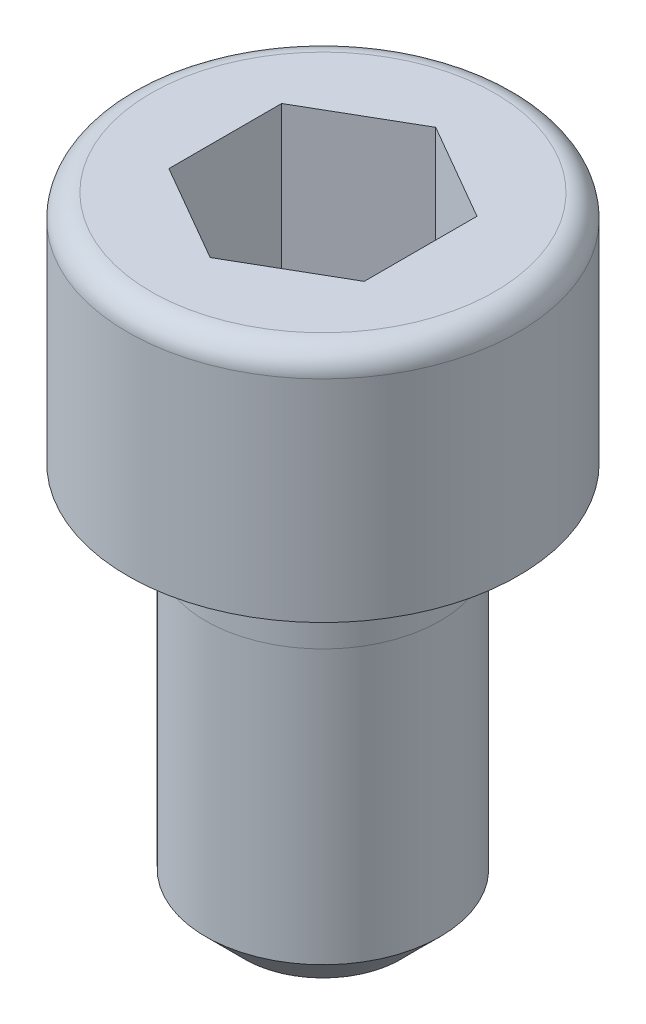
ISO-10303-21;
HEADER;
FILE_DESCRIPTION(('STEP AP214'),'2;1');
FILE_NAME('part.step','',(''),(''),'','','');
FILE_SCHEMA(('AUTOMOTIVE_DESIGN { 1 0 10303 214 1 1 1 1 }'));
ENDSEC;
DATA;
#1=APPLICATION_CONTEXT('core data for automotive mechanical design processes');
#2=APPLICATION_PROTOCOL_DEFINITION('international standard','automotive_design',2000,#1);
#3=PRODUCT_CONTEXT('',#1,'mechanical');
#4=PRODUCT('Part','Part','',(#3));
#5=PRODUCT_RELATED_PRODUCT_CATEGORY('part','',(#4));
#6=PRODUCT_DEFINITION_FORMATION('','',#4);
#7=PRODUCT_DEFINITION_CONTEXT('part definition',#1,'design');
#8=PRODUCT_DEFINITION('design','',#6,#7);
#9=PRODUCT_DEFINITION_SHAPE('','',#8);
#10=(LENGTH_UNIT() NAMED_UNIT(*) SI_UNIT(.MILLI.,.METRE.));
#11=(NAMED_UNIT(*) PLANE_ANGLE_UNIT() SI_UNIT($,.RADIAN.));
#12=(NAMED_UNIT(*) SI_UNIT($,.STERADIAN.) SOLID_ANGLE_UNIT());
#13=UNCERTAINTY_MEASURE_WITH_UNIT(LENGTH_MEASURE(1.E-05),#10,'distance_accuracy_value','');
#14=(GEOMETRIC_REPRESENTATION_CONTEXT(3) GLOBAL_UNCERTAINTY_ASSIGNED_CONTEXT((#13)) GLOBAL_UNIT_ASSIGNED_CONTEXT((#10,
#11,#12)) REPRESENTATION_CONTEXT('',''));
#15=CARTESIAN_POINT('',(0.,0.,0.));
#16=DIRECTION('',(0.,0.,1.));
#17=DIRECTION('',(1.,0.,0.));
#18=AXIS2_PLACEMENT_3D('',#15,#16,#17);
#19=CARTESIAN_POINT('',(0.,65.1172922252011,0.));
#20=DIRECTION('',(0.,1.,0.));
#21=DIRECTION('',(-1.,0.,0.));
#22=AXIS2_PLACEMENT_3D('',#19,#20,#21);
#23=CYLINDRICAL_SURFACE('',#22,2.99999999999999);
#24=CARTESIAN_POINT('',(0.,-15.,0.));
#25=DIRECTION('',(0.,1.,0.));
#26=DIRECTION('',(-1.,0.,0.));
#27=AXIS2_PLACEMENT_3D('',#24,#25,#26);
#28=CIRCLE('',#27,3.);
#29=CARTESIAN_POINT('',(-3.00000000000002,-15.,0.));
#30=VERTEX_POINT('',#29);
#31=EDGE_CURVE('E468',#30,#30,#28,.T.);
#32=ORIENTED_EDGE('',*,*,#31,.T.);
#33=EDGE_LOOP('',(#32));
#34=FACE_BOUND('',#33,.T.);
#35=CARTESIAN_POINT('',(0.,-7.99999999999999,0.));
#36=DIRECTION('',(0.,1.,0.));
#37=DIRECTION('',(-1.,0.,0.));
#38=AXIS2_PLACEMENT_3D('',#35,#36,#37);
#39=CIRCLE('',#38,2.99999999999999);
#40=CARTESIAN_POINT('',(-3.,-7.99999999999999,0.));
#41=VERTEX_POINT('',#40);
#42=EDGE_CURVE('E11',#41,#41,#39,.T.);
#43=ORIENTED_EDGE('',*,*,#42,.F.);
#44=EDGE_LOOP('',(#43));
#45=FACE_BOUND('',#44,.T.);
#46=ADVANCED_FACE('F348',(#34,#45),#23,.T.);
#47=CARTESIAN_POINT('',(2.,-16.,4.9960036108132E-13));
#48=DIRECTION('',(0.,-1.,0.));
#49=DIRECTION('',(1.,0.,0.));
#50=AXIS2_PLACEMENT_3D('',#47,#48,#49);
#51=PLANE('',#50);
#52=CARTESIAN_POINT('',(0.,-16.,0.));
#53=DIRECTION('',(0.,1.,0.));
#54=DIRECTION('',(-1.,0.,0.));
#55=AXIS2_PLACEMENT_3D('',#52,#53,#54);
#56=CIRCLE('',#55,2.);
#57=CARTESIAN_POINT('',(-1.99999999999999,-16.,0.));
#58=VERTEX_POINT('',#57);
#59=EDGE_CURVE('E357',#58,#58,#56,.T.);
#60=ORIENTED_EDGE('',*,*,#59,.F.);
#61=EDGE_LOOP('',(#60));
#62=FACE_BOUND('',#61,.T.);
#63=ADVANCED_FACE('F350',(#62),#51,.T.);
#64=CARTESIAN_POINT('',(0.,-16.,0.));
#65=DIRECTION('',(0.,1.,0.));
#66=DIRECTION('',(-1.,0.,0.));
#67=AXIS2_PLACEMENT_3D('',#64,#65,#66);
#68=CONICAL_SURFACE('',#67,2.,0.785398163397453);
#69=ORIENTED_EDGE('',*,*,#31,.F.);
#70=EDGE_LOOP('',(#69));
#71=FACE_BOUND('',#70,.T.);
#72=ORIENTED_EDGE('',*,*,#59,.T.);
#73=EDGE_LOOP('',(#72));
#74=FACE_BOUND('',#73,.T.);
#75=ADVANCED_FACE('F473',(#71,#74),#68,.T.);
#76=ORIENTED_EDGE('',*,*,#42,.T.);
#77=EDGE_LOOP('',(#76));
#78=FACE_BOUND('',#77,.T.);
#79=CARTESIAN_POINT('',(0.,-6.,0.));
#80=DIRECTION('',(0.,1.,0.));
#81=DIRECTION('',(-1.,0.,0.));
#82=AXIS2_PLACEMENT_3D('',#79,#80,#81);
#83=CIRCLE('',#82,2.99999999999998);
#84=CARTESIAN_POINT('',(-2.99999999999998,-6.,0.));
#85=VERTEX_POINT('',#84);
#86=EDGE_CURVE('E465',#85,#85,#83,.T.);
#87=ORIENTED_EDGE('',*,*,#86,.F.);
#88=EDGE_LOOP('',(#87));
#89=FACE_BOUND('',#88,.T.);
#90=ADVANCED_FACE('F479',(#78,#89),#23,.T.);
#91=CARTESIAN_POINT('',(3.00000000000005,-6.,4.9960036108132E-13));
#92=DIRECTION('',(0.,1.,0.));
#93=DIRECTION('',(-1.,0.,0.));
#94=AXIS2_PLACEMENT_3D('',#91,#92,#93);
#95=PLANE('',#94);
#96=CARTESIAN_POINT('',(0.,-6.,0.));
#97=DIRECTION('',(0.,1.,0.));
#98=DIRECTION('',(-1.,0.,0.));
#99=AXIS2_PLACEMENT_3D('',#96,#97,#98);
#100=CIRCLE('',#99,4.99999999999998);
#101=CARTESIAN_POINT('',(-4.99999999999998,-6.,0.));
#102=VERTEX_POINT('',#101);
#103=EDGE_CURVE('E462',#102,#102,#100,.T.);
#104=ORIENTED_EDGE('',*,*,#103,.F.);
#105=EDGE_LOOP('',(#104));
#106=FACE_BOUND('',#105,.T.);
#107=ORIENTED_EDGE('',*,*,#86,.T.);
#108=EDGE_LOOP('',(#107));
#109=FACE_BOUND('',#108,.T.);
#110=ADVANCED_FACE('F490',(#106,#109),#95,.F.);
#111=CARTESIAN_POINT('',(0.,65.1172922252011,0.));
#112=DIRECTION('',(0.,1.,0.));
#113=DIRECTION('',(-1.,0.,0.));
#114=AXIS2_PLACEMENT_3D('',#111,#112,#113);
#115=CYLINDRICAL_SURFACE('',#114,4.99999999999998);
#116=CARTESIAN_POINT('',(0.,-0.600000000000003,0.));
#117=DIRECTION('',(0.,1.,0.));
#118=DIRECTION('',(-1.,0.,0.));
#119=AXIS2_PLACEMENT_3D('',#116,#117,#118);
#120=CIRCLE('',#119,4.99999999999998);
#121=CARTESIAN_POINT('',(-4.99999999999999,-0.600000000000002,0.));
#122=VERTEX_POINT('',#121);
#123=EDGE_CURVE('E459',#122,#122,#120,.T.);
#124=ORIENTED_EDGE('',*,*,#123,.F.);
#125=EDGE_LOOP('',(#124));
#126=FACE_BOUND('',#125,.T.);
#127=ORIENTED_EDGE('',*,*,#103,.T.);
#128=EDGE_LOOP('',(#127));
#129=FACE_BOUND('',#128,.T.);
#130=ADVANCED_FACE('F495',(#126,#129),#115,.T.);
#131=CARTESIAN_POINT('',(0.,-0.600000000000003,0.));
#132=DIRECTION('',(0.,1.,0.));
#133=DIRECTION('',(-1.,0.,0.));
#134=AXIS2_PLACEMENT_3D('',#131,#132,#133);
#135=TOROIDAL_SURFACE('',#134,4.39999999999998,0.6);
#136=CARTESIAN_POINT('',(0.,0.,0.));
#137=DIRECTION('',(0.,1.,0.));
#138=DIRECTION('',(-1.,0.,0.));
#139=AXIS2_PLACEMENT_3D('',#136,#137,#138);
#140=CIRCLE('',#139,4.39999999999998);
#141=CARTESIAN_POINT('',(-4.4,0.,0.));
#142=VERTEX_POINT('',#141);
#143=EDGE_CURVE('E450',#142,#142,#140,.T.);
#144=ORIENTED_EDGE('',*,*,#143,.F.);
#145=EDGE_LOOP('',(#144));
#146=FACE_BOUND('',#145,.T.);
#147=ORIENTED_EDGE('',*,*,#123,.T.);
#148=EDGE_LOOP('',(#147));
#149=FACE_BOUND('',#148,.T.);
#150=ADVANCED_FACE('F504',(#146,#149),#135,.T.);
#151=CARTESIAN_POINT('',(4.39999999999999,0.,0.));
#152=DIRECTION('',(0.,-1.,0.));
#153=DIRECTION('',(1.,0.,0.));
#154=AXIS2_PLACEMENT_3D('',#151,#152,#153);
#155=PLANE('',#154);
#156=DIRECTION('',(0.,0.,1.00000000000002));
#157=VECTOR('',#156,1.);
#158=CARTESIAN_POINT('',(-2.49999999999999,0.,-1.44337567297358));
#159=LINE('',#158,#157);
#160=CARTESIAN_POINT('',(-2.49999999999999,0.,-1.44337567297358));
#161=VERTEX_POINT('',#160);
#162=CARTESIAN_POINT('',(-2.50000000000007,0.,1.4433756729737));
#163=VERTEX_POINT('',#162);
#164=EDGE_CURVE('E427',#161,#163,#159,.T.);
#165=ORIENTED_EDGE('',*,*,#164,.F.);
#166=DIRECTION('',(-0.866025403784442,0.,0.500000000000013));
#167=VECTOR('',#166,1.);
#168=CARTESIAN_POINT('',(0.,0.,-2.8867513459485));
#169=LINE('',#168,#167);
#170=CARTESIAN_POINT('',(0.,0.,-2.8867513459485));
#171=VERTEX_POINT('',#170);
#172=EDGE_CURVE('E364',#171,#161,#169,.T.);
#173=ORIENTED_EDGE('',*,*,#172,.F.);
#174=DIRECTION('',(0.866025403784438,0.,0.500000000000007));
#175=VECTOR('',#174,1.);
#176=CARTESIAN_POINT('',(0.,0.,-2.8867513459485));
#177=LINE('',#176,#175);
#178=CARTESIAN_POINT('',(2.50000000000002,0.,-1.44337567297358));
#179=VERTEX_POINT('',#178);
#180=EDGE_CURVE('E580',#171,#179,#177,.T.);
#181=ORIENTED_EDGE('',*,*,#180,.T.);
#182=DIRECTION('',(0.,0.,1.00000000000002));
#183=VECTOR('',#182,1.);
#184=CARTESIAN_POINT('',(2.50000000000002,0.,-1.44337567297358));
#185=LINE('',#184,#183);
#186=CARTESIAN_POINT('',(2.49999999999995,0.,1.44337567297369));
#187=VERTEX_POINT('',#186);
#188=EDGE_CURVE('E577',#179,#187,#185,.T.);
#189=ORIENTED_EDGE('',*,*,#188,.T.);
#190=DIRECTION('',(-0.866025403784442,0.,0.500000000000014));
#191=VECTOR('',#190,1.);
#192=CARTESIAN_POINT('',(2.49999999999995,0.,1.44337567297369));
#193=LINE('',#192,#191);
#194=CARTESIAN_POINT('',(0.,0.,2.88675134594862));
#195=VERTEX_POINT('',#194);
#196=EDGE_CURVE('E574',#187,#195,#193,.T.);
#197=ORIENTED_EDGE('',*,*,#196,.T.);
#198=DIRECTION('',(0.866025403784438,0.,0.500000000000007));
#199=VECTOR('',#198,1.);
#200=CARTESIAN_POINT('',(-2.50000000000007,0.,1.4433756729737));
#201=LINE('',#200,#199);
#202=EDGE_CURVE('E572',#163,#195,#201,.T.);
#203=ORIENTED_EDGE('',*,*,#202,.F.);
#204=EDGE_LOOP('',(#165,#173,#181,#189,#197,#203));
#205=FACE_BOUND('',#204,.T.);
#206=ORIENTED_EDGE('',*,*,#143,.T.);
#207=EDGE_LOOP('',(#206));
#208=FACE_BOUND('',#207,.T.);
#209=ADVANCED_FACE('F511',(#205,#208),#155,.F.);
#210=CARTESIAN_POINT('',(0.,-4.32,-2.8867513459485));
#211=DIRECTION('',(-0.499999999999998,0.,-0.866025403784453));
#212=DIRECTION('',(-0.866025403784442,0.,0.500000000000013));
#213=AXIS2_PLACEMENT_3D('',#210,#211,#212);
#214=PLANE('',#213);
#215=ORIENTED_EDGE('',*,*,#172,.T.);
#216=DIRECTION('',(0.,1.,0.));
#217=VECTOR('',#216,1.);
#218=CARTESIAN_POINT('',(-2.49999999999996,-4.32,-1.44337567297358));
#219=LINE('',#218,#217);
#220=CARTESIAN_POINT('',(-2.49999999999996,-4.32,-1.44337567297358));
#221=VERTEX_POINT('',#220);
#222=EDGE_CURVE('E432',#221,#161,#219,.T.);
#223=ORIENTED_EDGE('',*,*,#222,.F.);
#224=DIRECTION('',(-0.866025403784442,0.,0.500000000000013));
#225=VECTOR('',#224,1.);
#226=CARTESIAN_POINT('',(0.,-4.32,-2.8867513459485));
#227=LINE('',#226,#225);
#228=CARTESIAN_POINT('',(0.,-4.32,-2.8867513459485));
#229=VERTEX_POINT('',#228);
#230=EDGE_CURVE('E421',#229,#221,#227,.T.);
#231=ORIENTED_EDGE('',*,*,#230,.F.);
#232=DIRECTION('',(0.,1.,0.));
#233=VECTOR('',#232,1.);
#234=CARTESIAN_POINT('',(0.,-4.32,-2.8867513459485));
#235=LINE('',#234,#233);
#236=EDGE_CURVE('E448',#229,#171,#235,.T.);
#237=ORIENTED_EDGE('',*,*,#236,.T.);
#238=EDGE_LOOP('',(#215,#223,#231,#237));
#239=FACE_BOUND('',#238,.T.);
#240=ADVANCED_FACE('F515',(#239),#214,.F.);
#241=CARTESIAN_POINT('',(0.,-4.32,-2.8867513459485));
#242=DIRECTION('',(-0.500000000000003,0.,0.866025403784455));
#243=DIRECTION('',(0.866025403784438,0.,0.500000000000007));
#244=AXIS2_PLACEMENT_3D('',#241,#242,#243);
#245=PLANE('',#244);
#246=ORIENTED_EDGE('',*,*,#180,.F.);
#247=ORIENTED_EDGE('',*,*,#236,.F.);
#248=DIRECTION('',(0.866025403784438,0.,0.500000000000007));
#249=VECTOR('',#248,1.);
#250=CARTESIAN_POINT('',(0.,-4.32,-2.8867513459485));
#251=LINE('',#250,#249);
#252=CARTESIAN_POINT('',(2.50000000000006,-4.32,-1.44337567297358));
#253=VERTEX_POINT('',#252);
#254=EDGE_CURVE('E445',#229,#253,#251,.T.);
#255=ORIENTED_EDGE('',*,*,#254,.T.);
#256=DIRECTION('',(0.,1.,0.));
#257=VECTOR('',#256,1.);
#258=CARTESIAN_POINT('',(2.50000000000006,-4.32,-1.44337567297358));
#259=LINE('',#258,#257);
#260=EDGE_CURVE('E451',#253,#179,#259,.T.);
#261=ORIENTED_EDGE('',*,*,#260,.T.);
#262=EDGE_LOOP('',(#246,#247,#255,#261));
#263=FACE_BOUND('',#262,.T.);
#264=ADVANCED_FACE('F519',(#263),#245,.T.);
#265=CARTESIAN_POINT('',(2.50000000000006,-4.32,-1.44337567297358));
#266=DIRECTION('',(-1.,0.,0.));
#267=DIRECTION('',(0.,-1.,0.));
#268=AXIS2_PLACEMENT_3D('',#265,#266,#267);
#269=PLANE('',#268);
#270=ORIENTED_EDGE('',*,*,#188,.F.);
#271=ORIENTED_EDGE('',*,*,#260,.F.);
#272=DIRECTION('',(0.,0.,1.00000000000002));
#273=VECTOR('',#272,1.);
#274=CARTESIAN_POINT('',(2.50000000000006,-4.32,-1.44337567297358));
#275=LINE('',#274,#273);
#276=CARTESIAN_POINT('',(2.49999999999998,-4.32,1.44337567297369));
#277=VERTEX_POINT('',#276);
#278=EDGE_CURVE('E439',#253,#277,#275,.T.);
#279=ORIENTED_EDGE('',*,*,#278,.T.);
#280=DIRECTION('',(0.,1.,0.));
#281=VECTOR('',#280,1.);
#282=CARTESIAN_POINT('',(2.49999999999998,-4.32,1.44337567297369));
#283=LINE('',#282,#281);
#284=EDGE_CURVE('E453',#277,#187,#283,.T.);
#285=ORIENTED_EDGE('',*,*,#284,.T.);
#286=EDGE_LOOP('',(#270,#271,#279,#285));
#287=FACE_BOUND('',#286,.T.);
#288=ADVANCED_FACE('F529',(#287),#269,.T.);
#289=CARTESIAN_POINT('',(2.49999999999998,-4.32,1.44337567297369));
#290=DIRECTION('',(-0.499999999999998,0.,-0.866025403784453));
#291=DIRECTION('',(-0.866025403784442,0.,0.500000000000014));
#292=AXIS2_PLACEMENT_3D('',#289,#290,#291);
#293=PLANE('',#292);
#294=ORIENTED_EDGE('',*,*,#196,.F.);
#295=ORIENTED_EDGE('',*,*,#284,.F.);
#296=DIRECTION('',(-0.866025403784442,0.,0.500000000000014));
#297=VECTOR('',#296,1.);
#298=CARTESIAN_POINT('',(2.49999999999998,-4.32,1.44337567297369));
#299=LINE('',#298,#297);
#300=CARTESIAN_POINT('',(0.,-4.32,2.88675134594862));
#301=VERTEX_POINT('',#300);
#302=EDGE_CURVE('E436',#277,#301,#299,.T.);
#303=ORIENTED_EDGE('',*,*,#302,.T.);
#304=DIRECTION('',(0.,1.,0.));
#305=VECTOR('',#304,1.);
#306=CARTESIAN_POINT('',(0.,-4.32,2.88675134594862));
#307=LINE('',#306,#305);
#308=EDGE_CURVE('E431',#301,#195,#307,.T.);
#309=ORIENTED_EDGE('',*,*,#308,.T.);
#310=EDGE_LOOP('',(#294,#295,#303,#309));
#311=FACE_BOUND('',#310,.T.);
#312=ADVANCED_FACE('F526',(#311),#293,.T.);
#313=CARTESIAN_POINT('',(-2.50000000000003,-4.32,1.4433756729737));
#314=DIRECTION('',(-0.500000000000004,0.,0.866025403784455));
#315=DIRECTION('',(0.866025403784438,0.,0.500000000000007));
#316=AXIS2_PLACEMENT_3D('',#313,#314,#315);
#317=PLANE('',#316);
#318=ORIENTED_EDGE('',*,*,#202,.T.);
#319=ORIENTED_EDGE('',*,*,#308,.F.);
#320=DIRECTION('',(0.866025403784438,0.,0.500000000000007));
#321=VECTOR('',#320,1.);
#322=CARTESIAN_POINT('',(-2.50000000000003,-4.32,1.4433756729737));
#323=LINE('',#322,#321);
#324=CARTESIAN_POINT('',(-2.50000000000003,-4.32,1.4433756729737));
#325=VERTEX_POINT('',#324);
#326=EDGE_CURVE('E372',#325,#301,#323,.T.);
#327=ORIENTED_EDGE('',*,*,#326,.F.);
#328=DIRECTION('',(0.,1.,0.));
#329=VECTOR('',#328,1.);
#330=CARTESIAN_POINT('',(-2.50000000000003,-4.32,1.4433756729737));
#331=LINE('',#330,#329);
#332=EDGE_CURVE('E424',#325,#163,#331,.T.);
#333=ORIENTED_EDGE('',*,*,#332,.T.);
#334=EDGE_LOOP('',(#318,#319,#327,#333));
#335=FACE_BOUND('',#334,.T.);
#336=ADVANCED_FACE('F435',(#335),#317,.F.);
#337=CARTESIAN_POINT('',(-2.49999999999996,-4.32,-1.44337567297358));
#338=DIRECTION('',(-1.,0.,0.));
#339=DIRECTION('',(0.,-1.,0.));
#340=AXIS2_PLACEMENT_3D('',#337,#338,#339);
#341=PLANE('',#340);
#342=ORIENTED_EDGE('',*,*,#164,.T.);
#343=ORIENTED_EDGE('',*,*,#332,.F.);
#344=DIRECTION('',(0.,0.,1.00000000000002));
#345=VECTOR('',#344,1.);
#346=CARTESIAN_POINT('',(-2.49999999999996,-4.32,-1.44337567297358));
#347=LINE('',#346,#345);
#348=EDGE_CURVE('E414',#221,#325,#347,.T.);
#349=ORIENTED_EDGE('',*,*,#348,.F.);
#350=ORIENTED_EDGE('',*,*,#222,.T.);
#351=EDGE_LOOP('',(#342,#343,#349,#350));
#352=FACE_BOUND('',#351,.T.);
#353=ADVANCED_FACE('F425',(#352),#341,.F.);
#354=CARTESIAN_POINT('',(-2.49999999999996,-4.32,-1.44337567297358));
#355=DIRECTION('',(0.0942779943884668,0.98206244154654,0.163294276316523));
#356=DIRECTION('',(0.,-0.164024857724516,0.986456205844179));
#357=AXIS2_PLACEMENT_3D('',#354,#355,#356);
#358=PLANE('',#357);
#359=DIRECTION('',(-0.854296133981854,0.164024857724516,-0.493228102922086));
#360=VECTOR('',#359,1.);
#361=CARTESIAN_POINT('',(0.,-4.8,0.));
#362=LINE('',#361,#360);
#363=CARTESIAN_POINT('',(0.,-4.8,0.));
#364=VERTEX_POINT('',#363);
#365=EDGE_CURVE('E418',#364,#221,#362,.T.);
#366=ORIENTED_EDGE('',*,*,#365,.F.);
#367=DIRECTION('',(0.,0.164024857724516,-0.986456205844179));
#368=VECTOR('',#367,1.);
#369=CARTESIAN_POINT('',(0.,-4.8,0.));
#370=LINE('',#369,#368);
#371=EDGE_CURVE('E561',#364,#229,#370,.T.);
#372=ORIENTED_EDGE('',*,*,#371,.T.);
#373=ORIENTED_EDGE('',*,*,#230,.T.);
#374=EDGE_LOOP('',(#366,#372,#373));
#375=FACE_BOUND('',#374,.T.);
#376=ADVANCED_FACE('F522',(#375),#358,.T.);
#377=CARTESIAN_POINT('',(0.,-4.32,-2.8867513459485));
#378=DIRECTION('',(-0.0942779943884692,0.98206244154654,0.163294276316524));
#379=DIRECTION('',(0.,-0.164024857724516,0.986456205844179));
#380=AXIS2_PLACEMENT_3D('',#377,#378,#379);
#381=PLANE('',#380);
#382=ORIENTED_EDGE('',*,*,#371,.F.);
#383=DIRECTION('',(0.854296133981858,0.164024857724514,-0.493228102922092));
#384=VECTOR('',#383,1.);
#385=CARTESIAN_POINT('',(0.,-4.8,0.));
#386=LINE('',#385,#384);
#387=EDGE_CURVE('E410',#364,#253,#386,.T.);
#388=ORIENTED_EDGE('',*,*,#387,.T.);
#389=ORIENTED_EDGE('',*,*,#254,.F.);
#390=EDGE_LOOP('',(#382,#388,#389));
#391=FACE_BOUND('',#390,.T.);
#392=ADVANCED_FACE('F539',(#391),#381,.T.);
#393=CARTESIAN_POINT('',(-2.50000000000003,-4.32,1.4433756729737));
#394=DIRECTION('',(0.188555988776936,0.98206244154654,0.));
#395=DIRECTION('',(-0.982062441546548,0.188555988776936,0.));
#396=AXIS2_PLACEMENT_3D('',#393,#394,#395);
#397=PLANE('',#396);
#398=DIRECTION('',(-0.854296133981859,0.164024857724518,0.493228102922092));
#399=VECTOR('',#398,1.);
#400=CARTESIAN_POINT('',(0.,-4.8,0.));
#401=LINE('',#400,#399);
#402=EDGE_CURVE('E404',#364,#325,#401,.T.);
#403=ORIENTED_EDGE('',*,*,#402,.F.);
#404=ORIENTED_EDGE('',*,*,#365,.T.);
#405=ORIENTED_EDGE('',*,*,#348,.T.);
#406=EDGE_LOOP('',(#403,#404,#405));
#407=FACE_BOUND('',#406,.T.);
#408=ADVANCED_FACE('F416',(#407),#397,.T.);
#409=CARTESIAN_POINT('',(2.50000000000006,-4.32,-1.44337567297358));
#410=DIRECTION('',(-0.188555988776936,0.98206244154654,0.));
#411=DIRECTION('',(-0.982062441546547,-0.188555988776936,0.));
#412=AXIS2_PLACEMENT_3D('',#409,#410,#411);
#413=PLANE('',#412);
#414=ORIENTED_EDGE('',*,*,#387,.F.);
#415=DIRECTION('',(0.854296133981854,0.164024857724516,0.493228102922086));
#416=VECTOR('',#415,1.);
#417=CARTESIAN_POINT('',(0.,-4.8,0.));
#418=LINE('',#417,#416);
#419=EDGE_CURVE('E411',#364,#277,#418,.T.);
#420=ORIENTED_EDGE('',*,*,#419,.T.);
#421=ORIENTED_EDGE('',*,*,#278,.F.);
#422=EDGE_LOOP('',(#414,#420,#421));
#423=FACE_BOUND('',#422,.T.);
#424=ADVANCED_FACE('F546',(#423),#413,.T.);
#425=CARTESIAN_POINT('',(0.,-4.32,2.88675134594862));
#426=DIRECTION('',(0.0942779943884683,0.98206244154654,-0.163294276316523));
#427=DIRECTION('',(0.,0.164024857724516,0.986456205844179));
#428=AXIS2_PLACEMENT_3D('',#425,#426,#427);
#429=PLANE('',#428);
#430=DIRECTION('',(0.,0.164024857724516,0.986456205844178));
#431=VECTOR('',#430,1.);
#432=CARTESIAN_POINT('',(0.,-4.8,0.));
#433=LINE('',#432,#431);
#434=EDGE_CURVE('E407',#364,#301,#433,.T.);
#435=ORIENTED_EDGE('',*,*,#434,.F.);
#436=ORIENTED_EDGE('',*,*,#402,.T.);
#437=ORIENTED_EDGE('',*,*,#326,.T.);
#438=EDGE_LOOP('',(#435,#436,#437));
#439=FACE_BOUND('',#438,.T.);
#440=ADVANCED_FACE('F406',(#439),#429,.T.);
#441=CARTESIAN_POINT('',(2.49999999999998,-4.32,1.44337567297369));
#442=DIRECTION('',(-0.0942779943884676,0.98206244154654,-0.163294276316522));
#443=DIRECTION('',(0.,0.164024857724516,0.986456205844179));
#444=AXIS2_PLACEMENT_3D('',#441,#442,#443);
#445=PLANE('',#444);
#446=ORIENTED_EDGE('',*,*,#419,.F.);
#447=ORIENTED_EDGE('',*,*,#434,.T.);
#448=ORIENTED_EDGE('',*,*,#302,.F.);
#449=EDGE_LOOP('',(#446,#447,#448));
#450=FACE_BOUND('',#449,.T.);
#451=ADVANCED_FACE('F523',(#450),#445,.T.);
#452=CLOSED_SHELL('',(#46,#63,#75,#90,#110,#130,#150,#209,#240,#264,#288,#312,#336,#353,#376,
#392,#408,#424,#440,#451));
#453=MANIFOLD_SOLID_BREP('B2',#452);
#454=ADVANCED_BREP_SHAPE_REPRESENTATION('',(#18,#453),#14);
#455=SHAPE_DEFINITION_REPRESENTATION(#9,#454);
ENDSEC;
END-ISO-10303-21;
